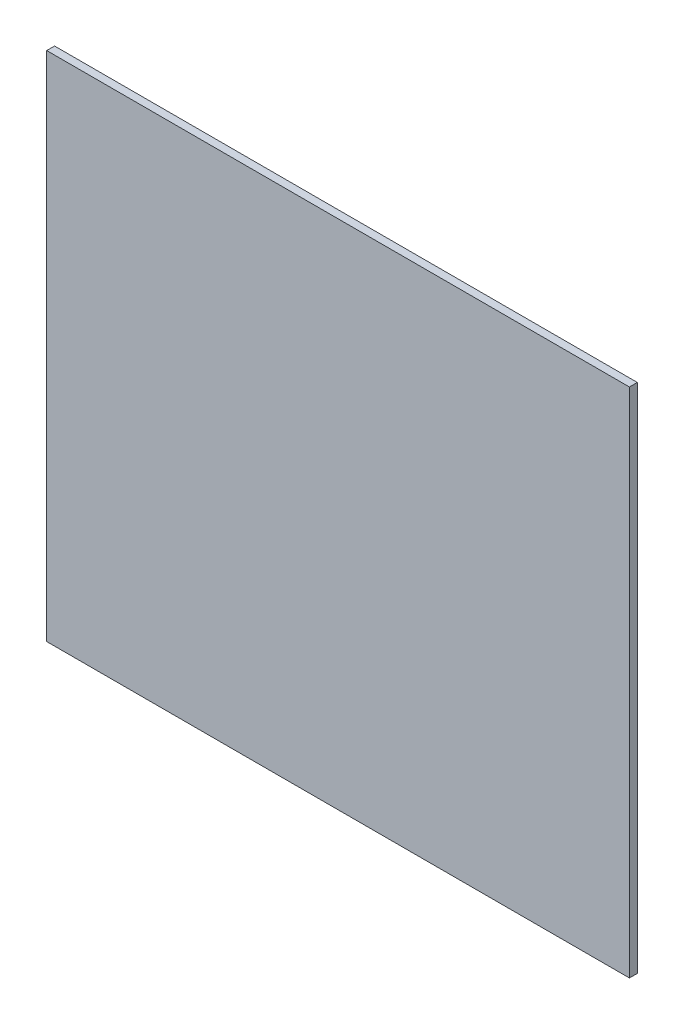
ISO-10303-21;
HEADER;
FILE_DESCRIPTION(('STEP AP214'),'2;1');
FILE_NAME('part.step','',(''),(''),'','','');
FILE_SCHEMA(('AUTOMOTIVE_DESIGN { 1 0 10303 214 1 1 1 1 }'));
ENDSEC;
DATA;
#1=APPLICATION_CONTEXT('core data for automotive mechanical design processes');
#2=APPLICATION_PROTOCOL_DEFINITION('international standard','automotive_design',2000,#1);
#3=PRODUCT_CONTEXT('',#1,'mechanical');
#4=PRODUCT('Part','Part','',(#3));
#5=PRODUCT_RELATED_PRODUCT_CATEGORY('part','',(#4));
#6=PRODUCT_DEFINITION_FORMATION('','',#4);
#7=PRODUCT_DEFINITION_CONTEXT('part definition',#1,'design');
#8=PRODUCT_DEFINITION('design','',#6,#7);
#9=PRODUCT_DEFINITION_SHAPE('','',#8);
#10=(LENGTH_UNIT() NAMED_UNIT(*) SI_UNIT(.MILLI.,.METRE.));
#11=(NAMED_UNIT(*) PLANE_ANGLE_UNIT() SI_UNIT($,.RADIAN.));
#12=(NAMED_UNIT(*) SI_UNIT($,.STERADIAN.) SOLID_ANGLE_UNIT());
#13=UNCERTAINTY_MEASURE_WITH_UNIT(LENGTH_MEASURE(1.E-05),#10,'distance_accuracy_value','');
#14=(GEOMETRIC_REPRESENTATION_CONTEXT(3) GLOBAL_UNCERTAINTY_ASSIGNED_CONTEXT((#13)) GLOBAL_UNIT_ASSIGNED_CONTEXT((#10,
#11,#12)) REPRESENTATION_CONTEXT('',''));
#15=CARTESIAN_POINT('',(0.,0.,0.));
#16=DIRECTION('',(0.,0.,1.));
#17=DIRECTION('',(1.,0.,0.));
#18=AXIS2_PLACEMENT_3D('',#15,#16,#17);
#19=CARTESIAN_POINT('',(469.9,-412.75,6.35));
#20=DIRECTION('',(-1.,0.,0.));
#21=DIRECTION('',(0.,0.,1.));
#22=AXIS2_PLACEMENT_3D('',#19,#20,#21);
#23=PLANE('',#22);
#24=DIRECTION('',(0.,1.,0.));
#25=VECTOR('',#24,1.);
#26=CARTESIAN_POINT('',(469.9,-412.75,-6.35));
#27=LINE('',#26,#25);
#28=CARTESIAN_POINT('',(469.9,-412.75,-6.35));
#29=VERTEX_POINT('',#28);
#30=CARTESIAN_POINT('',(469.9,412.75,-6.35));
#31=VERTEX_POINT('',#30);
#32=EDGE_CURVE('E93',#29,#31,#27,.T.);
#33=ORIENTED_EDGE('',*,*,#32,.T.);
#34=DIRECTION('',(0.,0.,-1.));
#35=VECTOR('',#34,1.);
#36=CARTESIAN_POINT('',(469.9,412.75,6.35));
#37=LINE('',#36,#35);
#38=CARTESIAN_POINT('',(469.9,412.75,6.35));
#39=VERTEX_POINT('',#38);
#40=EDGE_CURVE('E11',#39,#31,#37,.T.);
#41=ORIENTED_EDGE('',*,*,#40,.F.);
#42=DIRECTION('',(0.,1.,0.));
#43=VECTOR('',#42,1.);
#44=CARTESIAN_POINT('',(469.9,-412.75,6.35));
#45=LINE('',#44,#43);
#46=CARTESIAN_POINT('',(469.9,-412.75,6.35));
#47=VERTEX_POINT('',#46);
#48=EDGE_CURVE('E81',#47,#39,#45,.T.);
#49=ORIENTED_EDGE('',*,*,#48,.F.);
#50=DIRECTION('',(0.,0.,-1.));
#51=VECTOR('',#50,1.);
#52=CARTESIAN_POINT('',(469.9,-412.75,6.35));
#53=LINE('',#52,#51);
#54=EDGE_CURVE('E89',#47,#29,#53,.T.);
#55=ORIENTED_EDGE('',*,*,#54,.T.);
#56=EDGE_LOOP('',(#33,#41,#49,#55));
#57=FACE_BOUND('',#56,.T.);
#58=ADVANCED_FACE('F30',(#57),#23,.F.);
#59=CARTESIAN_POINT('',(-469.9,412.75,6.35));
#60=DIRECTION('',(0.,-1.,0.));
#61=DIRECTION('',(0.,0.,-1.));
#62=AXIS2_PLACEMENT_3D('',#59,#60,#61);
#63=PLANE('',#62);
#64=DIRECTION('',(-1.,0.,0.));
#65=VECTOR('',#64,1.);
#66=CARTESIAN_POINT('',(-469.9,412.75,-6.35));
#67=LINE('',#66,#65);
#68=CARTESIAN_POINT('',(-469.9,412.75,-6.35));
#69=VERTEX_POINT('',#68);
#70=EDGE_CURVE('E85',#31,#69,#67,.T.);
#71=ORIENTED_EDGE('',*,*,#70,.T.);
#72=DIRECTION('',(0.,0.,-1.));
#73=VECTOR('',#72,1.);
#74=CARTESIAN_POINT('',(-469.9,412.75,6.35));
#75=LINE('',#74,#73);
#76=CARTESIAN_POINT('',(-469.9,412.75,6.35));
#77=VERTEX_POINT('',#76);
#78=EDGE_CURVE('E38',#77,#69,#75,.T.);
#79=ORIENTED_EDGE('',*,*,#78,.F.);
#80=DIRECTION('',(-1.,0.,0.));
#81=VECTOR('',#80,1.);
#82=CARTESIAN_POINT('',(-469.9,412.75,6.35));
#83=LINE('',#82,#81);
#84=EDGE_CURVE('E76',#39,#77,#83,.T.);
#85=ORIENTED_EDGE('',*,*,#84,.F.);
#86=ORIENTED_EDGE('',*,*,#40,.T.);
#87=EDGE_LOOP('',(#71,#79,#85,#86));
#88=FACE_BOUND('',#87,.T.);
#89=ADVANCED_FACE('F84',(#88),#63,.F.);
#90=CARTESIAN_POINT('',(-469.9,-412.75,6.35));
#91=DIRECTION('',(1.,0.,0.));
#92=DIRECTION('',(0.,0.,-1.));
#93=AXIS2_PLACEMENT_3D('',#90,#91,#92);
#94=PLANE('',#93);
#95=DIRECTION('',(0.,-1.,0.));
#96=VECTOR('',#95,1.);
#97=CARTESIAN_POINT('',(-469.9,-412.75,-6.35));
#98=LINE('',#97,#96);
#99=CARTESIAN_POINT('',(-469.9,-412.75,-6.35));
#100=VERTEX_POINT('',#99);
#101=EDGE_CURVE('E63',#69,#100,#98,.T.);
#102=ORIENTED_EDGE('',*,*,#101,.T.);
#103=DIRECTION('',(0.,0.,-1.));
#104=VECTOR('',#103,1.);
#105=CARTESIAN_POINT('',(-469.9,-412.75,6.35));
#106=LINE('',#105,#104);
#107=CARTESIAN_POINT('',(-469.9,-412.75,6.35));
#108=VERTEX_POINT('',#107);
#109=EDGE_CURVE('E86',#108,#100,#106,.T.);
#110=ORIENTED_EDGE('',*,*,#109,.F.);
#111=DIRECTION('',(0.,-1.,0.));
#112=VECTOR('',#111,1.);
#113=CARTESIAN_POINT('',(-469.9,-412.75,6.35));
#114=LINE('',#113,#112);
#115=EDGE_CURVE('E79',#77,#108,#114,.T.);
#116=ORIENTED_EDGE('',*,*,#115,.F.);
#117=ORIENTED_EDGE('',*,*,#78,.T.);
#118=EDGE_LOOP('',(#102,#110,#116,#117));
#119=FACE_BOUND('',#118,.T.);
#120=ADVANCED_FACE('F87',(#119),#94,.F.);
#121=CARTESIAN_POINT('',(-469.9,-412.75,6.35));
#122=DIRECTION('',(0.,1.,0.));
#123=DIRECTION('',(0.,0.,1.));
#124=AXIS2_PLACEMENT_3D('',#121,#122,#123);
#125=PLANE('',#124);
#126=DIRECTION('',(1.,0.,0.));
#127=VECTOR('',#126,1.);
#128=CARTESIAN_POINT('',(-469.9,-412.75,-6.35));
#129=LINE('',#128,#127);
#130=EDGE_CURVE('E69',#100,#29,#129,.T.);
#131=ORIENTED_EDGE('',*,*,#130,.T.);
#132=ORIENTED_EDGE('',*,*,#54,.F.);
#133=DIRECTION('',(1.,0.,0.));
#134=VECTOR('',#133,1.);
#135=CARTESIAN_POINT('',(-469.9,-412.75,6.35));
#136=LINE('',#135,#134);
#137=EDGE_CURVE('E46',#108,#47,#136,.T.);
#138=ORIENTED_EDGE('',*,*,#137,.F.);
#139=ORIENTED_EDGE('',*,*,#109,.T.);
#140=EDGE_LOOP('',(#131,#132,#138,#139));
#141=FACE_BOUND('',#140,.T.);
#142=ADVANCED_FACE('F100',(#141),#125,.F.);
#143=CARTESIAN_POINT('',(469.9,412.75,6.35));
#144=DIRECTION('',(0.,0.,-1.));
#145=DIRECTION('',(-1.,0.,0.));
#146=AXIS2_PLACEMENT_3D('',#143,#144,#145);
#147=PLANE('',#146);
#148=ORIENTED_EDGE('',*,*,#48,.T.);
#149=ORIENTED_EDGE('',*,*,#84,.T.);
#150=ORIENTED_EDGE('',*,*,#115,.T.);
#151=ORIENTED_EDGE('',*,*,#137,.T.);
#152=EDGE_LOOP('',(#148,#149,#150,#151));
#153=FACE_BOUND('',#152,.T.);
#154=ADVANCED_FACE('F77',(#153),#147,.F.);
#155=CARTESIAN_POINT('',(469.9,412.75,-6.35));
#156=DIRECTION('',(0.,0.,-1.));
#157=DIRECTION('',(-1.,0.,0.));
#158=AXIS2_PLACEMENT_3D('',#155,#156,#157);
#159=PLANE('',#158);
#160=ORIENTED_EDGE('',*,*,#32,.F.);
#161=ORIENTED_EDGE('',*,*,#130,.F.);
#162=ORIENTED_EDGE('',*,*,#101,.F.);
#163=ORIENTED_EDGE('',*,*,#70,.F.);
#164=EDGE_LOOP('',(#160,#161,#162,#163));
#165=FACE_BOUND('',#164,.T.);
#166=ADVANCED_FACE('F103',(#165),#159,.T.);
#167=CLOSED_SHELL('',(#58,#89,#120,#142,#154,#166));
#168=MANIFOLD_SOLID_BREP('B2',#167);
#169=ADVANCED_BREP_SHAPE_REPRESENTATION('',(#18,#168),#14);
#170=SHAPE_DEFINITION_REPRESENTATION(#9,#169);
ENDSEC;
END-ISO-10303-21;
